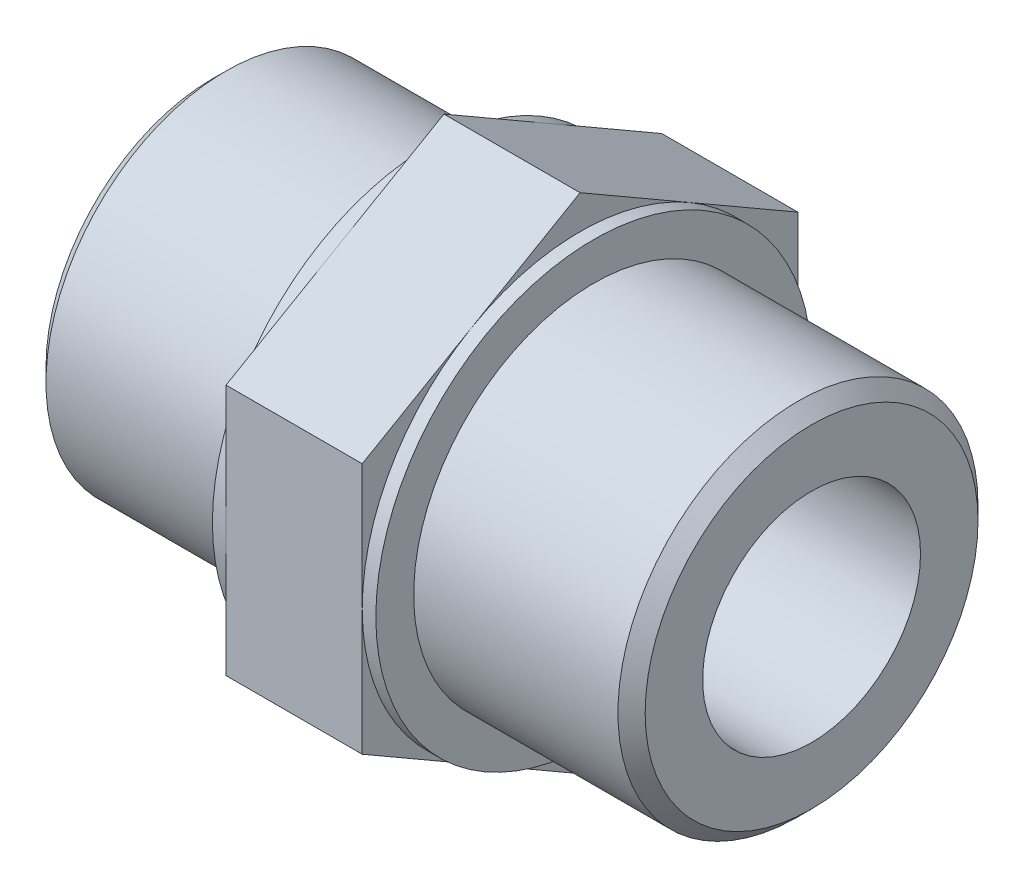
ISO-10303-21;
HEADER;
FILE_DESCRIPTION(('STEP AP214'),'2;1');
FILE_NAME('part.step','',(''),(''),'','','');
FILE_SCHEMA(('AUTOMOTIVE_DESIGN { 1 0 10303 214 1 1 1 1 }'));
ENDSEC;
DATA;
#1=APPLICATION_CONTEXT('core data for automotive mechanical design processes');
#2=APPLICATION_PROTOCOL_DEFINITION('international standard','automotive_design',2000,#1);
#3=PRODUCT_CONTEXT('',#1,'mechanical');
#4=PRODUCT('Part','Part','',(#3));
#5=PRODUCT_RELATED_PRODUCT_CATEGORY('part','',(#4));
#6=PRODUCT_DEFINITION_FORMATION('','',#4);
#7=PRODUCT_DEFINITION_CONTEXT('part definition',#1,'design');
#8=PRODUCT_DEFINITION('design','',#6,#7);
#9=PRODUCT_DEFINITION_SHAPE('','',#8);
#10=(LENGTH_UNIT() NAMED_UNIT(*) SI_UNIT(.MILLI.,.METRE.));
#11=(NAMED_UNIT(*) PLANE_ANGLE_UNIT() SI_UNIT($,.RADIAN.));
#12=(NAMED_UNIT(*) SI_UNIT($,.STERADIAN.) SOLID_ANGLE_UNIT());
#13=UNCERTAINTY_MEASURE_WITH_UNIT(LENGTH_MEASURE(1.E-05),#10,'distance_accuracy_value','');
#14=(GEOMETRIC_REPRESENTATION_CONTEXT(3) GLOBAL_UNCERTAINTY_ASSIGNED_CONTEXT((#13)) GLOBAL_UNIT_ASSIGNED_CONTEXT((#10,
#11,#12)) REPRESENTATION_CONTEXT('',''));
#15=CARTESIAN_POINT('',(0.,0.,0.));
#16=DIRECTION('',(0.,0.,1.));
#17=DIRECTION('',(1.,0.,0.));
#18=AXIS2_PLACEMENT_3D('',#15,#16,#17);
#19=CARTESIAN_POINT('',(-36.444351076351,18.475,0.));
#20=DIRECTION('',(0.999999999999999,0.,0.));
#21=DIRECTION('',(0.,0.,-1.));
#22=AXIS2_PLACEMENT_3D('',#19,#20,#21);
#23=PLANE('',#22);
#24=CARTESIAN_POINT('',(-36.444351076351,0.,0.));
#25=DIRECTION('',(0.999999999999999,0.,0.));
#26=DIRECTION('',(0.,0.,-1.));
#27=AXIS2_PLACEMENT_3D('',#24,#25,#26);
#28=CIRCLE('',#27,18.475);
#29=CARTESIAN_POINT('',(-36.4443510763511,9.23718707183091,-16.));
#30=VERTEX_POINT('',#29);
#31=CARTESIAN_POINT('',(-36.444351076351,9.2378129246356,-15.9996386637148));
#32=VERTEX_POINT('',#31);
#33=EDGE_CURVE('E186',#30,#32,#28,.T.);
#34=ORIENTED_EDGE('',*,*,#33,.T.);
#35=DIRECTION('',(0.,0.499999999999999,0.86602540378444));
#36=VECTOR('',#35,1.);
#37=CARTESIAN_POINT('',(-36.4443510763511,9.23760430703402,-16.));
#38=LINE('',#37,#36);
#39=CARTESIAN_POINT('',(-36.444351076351,13.856406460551,-8.));
#40=VERTEX_POINT('',#39);
#41=EDGE_CURVE('E409',#32,#40,#38,.T.);
#42=ORIENTED_EDGE('',*,*,#41,.T.);
#43=CARTESIAN_POINT('',(-36.444351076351,0.,0.));
#44=DIRECTION('',(0.999999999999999,0.,0.));
#45=DIRECTION('',(0.,0.,-1.));
#46=AXIS2_PLACEMENT_3D('',#43,#44,#45);
#47=CIRCLE('',#46,16.);
#48=CARTESIAN_POINT('',(-36.444351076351,0.,-16.));
#49=VERTEX_POINT('',#48);
#50=EDGE_CURVE('E198',#49,#40,#47,.T.);
#51=ORIENTED_EDGE('',*,*,#50,.F.);
#52=DIRECTION('',(0.,0.999999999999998,0.));
#53=VECTOR('',#52,1.);
#54=CARTESIAN_POINT('',(-36.4443510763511,-9.23760430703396,-16.));
#55=LINE('',#54,#53);
#56=EDGE_CURVE('E391',#49,#30,#55,.T.);
#57=ORIENTED_EDGE('',*,*,#56,.T.);
#58=EDGE_LOOP('',(#34,#42,#51,#57));
#59=FACE_BOUND('',#58,.T.);
#60=ADVANCED_FACE('F35',(#59),#23,.T.);
#61=CARTESIAN_POINT('',(-36.444351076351,13.856406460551,8.00000000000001));
#62=VERTEX_POINT('',#61);
#63=EDGE_CURVE('E202',#40,#62,#47,.T.);
#64=ORIENTED_EDGE('',*,*,#63,.F.);
#65=CARTESIAN_POINT('',(-36.444351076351,18.4749999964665,-0.000361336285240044));
#66=VERTEX_POINT('',#65);
#67=EDGE_CURVE('E185',#40,#66,#38,.T.);
#68=ORIENTED_EDGE('',*,*,#67,.T.);
#69=CARTESIAN_POINT('',(-36.444351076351,18.4749999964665,0.000361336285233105));
#70=VERTEX_POINT('',#69);
#71=EDGE_CURVE('E177',#66,#70,#28,.T.);
#72=ORIENTED_EDGE('',*,*,#71,.T.);
#73=DIRECTION('',(0.,-0.499999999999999,0.866025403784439));
#74=VECTOR('',#73,1.);
#75=CARTESIAN_POINT('',(-36.444351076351,18.475208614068,0.));
#76=LINE('',#75,#74);
#77=EDGE_CURVE('E159',#70,#62,#76,.T.);
#78=ORIENTED_EDGE('',*,*,#77,.T.);
#79=EDGE_LOOP('',(#64,#68,#72,#78));
#80=FACE_BOUND('',#79,.T.);
#81=ADVANCED_FACE('F184',(#80),#23,.T.);
#82=CARTESIAN_POINT('',(-36.444351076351,-9.23781292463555,-15.9996386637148));
#83=VERTEX_POINT('',#82);
#84=CARTESIAN_POINT('',(-36.4443510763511,-9.23718707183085,-16.));
#85=VERTEX_POINT('',#84);
#86=EDGE_CURVE('E191',#83,#85,#28,.T.);
#87=ORIENTED_EDGE('',*,*,#86,.T.);
#88=EDGE_CURVE('E399',#85,#49,#55,.T.);
#89=ORIENTED_EDGE('',*,*,#88,.T.);
#90=CARTESIAN_POINT('',(-36.444351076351,-13.856406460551,-8.00000000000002));
#91=VERTEX_POINT('',#90);
#92=EDGE_CURVE('E190',#91,#49,#47,.T.);
#93=ORIENTED_EDGE('',*,*,#92,.F.);
#94=DIRECTION('',(0.,0.499999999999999,-0.86602540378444));
#95=VECTOR('',#94,1.);
#96=CARTESIAN_POINT('',(-36.4443510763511,-18.475208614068,0.));
#97=LINE('',#96,#95);
#98=EDGE_CURVE('E381',#91,#83,#97,.T.);
#99=ORIENTED_EDGE('',*,*,#98,.T.);
#100=EDGE_LOOP('',(#87,#89,#93,#99));
#101=FACE_BOUND('',#100,.T.);
#102=ADVANCED_FACE('F243',(#101),#23,.T.);
#103=CARTESIAN_POINT('',(-36.444351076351,-18.4749999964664,0.000361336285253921));
#104=VERTEX_POINT('',#103);
#105=CARTESIAN_POINT('',(-36.444351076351,-18.4749999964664,-0.000361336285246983));
#106=VERTEX_POINT('',#105);
#107=EDGE_CURVE('E362',#104,#106,#28,.T.);
#108=ORIENTED_EDGE('',*,*,#107,.T.);
#109=EDGE_CURVE('E388',#106,#91,#97,.T.);
#110=ORIENTED_EDGE('',*,*,#109,.T.);
#111=CARTESIAN_POINT('',(-36.444351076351,-13.856406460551,7.99999999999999));
#112=VERTEX_POINT('',#111);
#113=EDGE_CURVE('E407',#112,#91,#47,.T.);
#114=ORIENTED_EDGE('',*,*,#113,.F.);
#115=DIRECTION('',(0.,-0.499999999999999,-0.86602540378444));
#116=VECTOR('',#115,1.);
#117=CARTESIAN_POINT('',(-36.444351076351,-9.23760430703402,16.));
#118=LINE('',#117,#116);
#119=EDGE_CURVE('E393',#112,#104,#118,.T.);
#120=ORIENTED_EDGE('',*,*,#119,.T.);
#121=EDGE_LOOP('',(#108,#110,#114,#120));
#122=FACE_BOUND('',#121,.T.);
#123=ADVANCED_FACE('F255',(#122),#23,.T.);
#124=CARTESIAN_POINT('',(-36.444351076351,-9.23718707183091,16.));
#125=VERTEX_POINT('',#124);
#126=CARTESIAN_POINT('',(-36.444351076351,-9.23781292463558,15.9996386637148));
#127=VERTEX_POINT('',#126);
#128=EDGE_CURVE('E193',#125,#127,#28,.T.);
#129=ORIENTED_EDGE('',*,*,#128,.T.);
#130=EDGE_CURVE('E389',#127,#112,#118,.T.);
#131=ORIENTED_EDGE('',*,*,#130,.T.);
#132=CARTESIAN_POINT('',(-36.444351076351,0.,16.));
#133=VERTEX_POINT('',#132);
#134=EDGE_CURVE('E413',#133,#112,#47,.T.);
#135=ORIENTED_EDGE('',*,*,#134,.F.);
#136=DIRECTION('',(0.,-0.999999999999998,0.));
#137=VECTOR('',#136,1.);
#138=CARTESIAN_POINT('',(-36.444351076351,9.23760430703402,16.));
#139=LINE('',#138,#137);
#140=EDGE_CURVE('E170',#133,#125,#139,.T.);
#141=ORIENTED_EDGE('',*,*,#140,.T.);
#142=EDGE_LOOP('',(#129,#131,#135,#141));
#143=FACE_BOUND('',#142,.T.);
#144=ADVANCED_FACE('F247',(#143),#23,.T.);
#145=CARTESIAN_POINT('',(-36.444351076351,9.23781292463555,15.9996386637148));
#146=VERTEX_POINT('',#145);
#147=CARTESIAN_POINT('',(-36.444351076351,9.23718707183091,16.));
#148=VERTEX_POINT('',#147);
#149=EDGE_CURVE('E187',#146,#148,#28,.T.);
#150=ORIENTED_EDGE('',*,*,#149,.T.);
#151=EDGE_CURVE('E259',#148,#133,#139,.T.);
#152=ORIENTED_EDGE('',*,*,#151,.T.);
#153=EDGE_CURVE('E412',#62,#133,#47,.T.);
#154=ORIENTED_EDGE('',*,*,#153,.F.);
#155=EDGE_CURVE('E165',#62,#146,#76,.T.);
#156=ORIENTED_EDGE('',*,*,#155,.T.);
#157=EDGE_LOOP('',(#150,#152,#154,#156));
#158=FACE_BOUND('',#157,.T.);
#159=ADVANCED_FACE('F239',(#158),#23,.T.);
#160=CARTESIAN_POINT('',(0.,0.,0.));
#161=DIRECTION('',(0.999999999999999,0.,0.));
#162=DIRECTION('',(0.,0.,-1.));
#163=AXIS2_PLACEMENT_3D('',#160,#161,#162);
#164=CYLINDRICAL_SURFACE('',#163,18.475);
#165=ORIENTED_EDGE('',*,*,#71,.F.);
#166=DIRECTION('',(0.999999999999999,0.,0.));
#167=VECTOR('',#166,1.);
#168=CARTESIAN_POINT('',(0.,18.4749999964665,-0.000361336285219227));
#169=LINE('',#168,#167);
#170=CARTESIAN_POINT('',(-46.444351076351,18.475,-0.000361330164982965));
#171=VERTEX_POINT('',#170);
#172=EDGE_CURVE('E312',#66,#171,#169,.F.);
#173=ORIENTED_EDGE('',*,*,#172,.T.);
#174=CARTESIAN_POINT('',(-46.444351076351,0.,0.));
#175=DIRECTION('',(0.999999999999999,0.,0.));
#176=DIRECTION('',(0.,0.,-1.));
#177=AXIS2_PLACEMENT_3D('',#174,#175,#176);
#178=CIRCLE('',#177,18.475);
#179=CARTESIAN_POINT('',(-46.444351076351,18.4749999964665,0.000361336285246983));
#180=VERTEX_POINT('',#179);
#181=EDGE_CURVE('E179',#171,#180,#178,.T.);
#182=ORIENTED_EDGE('',*,*,#181,.T.);
#183=DIRECTION('',(0.999999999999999,0.,0.));
#184=VECTOR('',#183,1.);
#185=CARTESIAN_POINT('',(0.,18.4749999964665,0.000361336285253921));
#186=LINE('',#185,#184);
#187=EDGE_CURVE('E162',#180,#70,#186,.T.);
#188=ORIENTED_EDGE('',*,*,#187,.T.);
#189=EDGE_LOOP('',(#165,#173,#182,#188));
#190=FACE_BOUND('',#189,.T.);
#191=ADVANCED_FACE('F175',(#190),#164,.T.);
#192=CARTESIAN_POINT('',(-46.444351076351,9.23718707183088,-16.));
#193=VERTEX_POINT('',#192);
#194=CARTESIAN_POINT('',(-46.444351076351,9.23781292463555,-15.9996386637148));
#195=VERTEX_POINT('',#194);
#196=EDGE_CURVE('E196',#193,#195,#178,.T.);
#197=ORIENTED_EDGE('',*,*,#196,.T.);
#198=DIRECTION('',(0.999999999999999,0.,0.));
#199=VECTOR('',#198,1.);
#200=CARTESIAN_POINT('',(0.,9.23781292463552,-15.9996386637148));
#201=LINE('',#200,#199);
#202=EDGE_CURVE('E308',#195,#32,#201,.T.);
#203=ORIENTED_EDGE('',*,*,#202,.T.);
#204=ORIENTED_EDGE('',*,*,#33,.F.);
#205=DIRECTION('',(0.999999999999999,0.,0.));
#206=VECTOR('',#205,1.);
#207=CARTESIAN_POINT('',(0.,9.23718707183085,-16.));
#208=LINE('',#207,#206);
#209=EDGE_CURVE('E302',#30,#193,#208,.F.);
#210=ORIENTED_EDGE('',*,*,#209,.T.);
#211=EDGE_LOOP('',(#197,#203,#204,#210));
#212=FACE_BOUND('',#211,.T.);
#213=ADVANCED_FACE('F253',(#212),#164,.T.);
#214=CARTESIAN_POINT('',(-46.4443510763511,-9.23781292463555,-15.9996386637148));
#215=VERTEX_POINT('',#214);
#216=CARTESIAN_POINT('',(-46.444351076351,-9.23718707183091,-16.));
#217=VERTEX_POINT('',#216);
#218=EDGE_CURVE('E322',#215,#217,#178,.T.);
#219=ORIENTED_EDGE('',*,*,#218,.T.);
#220=DIRECTION('',(0.999999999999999,0.,0.));
#221=VECTOR('',#220,1.);
#222=CARTESIAN_POINT('',(0.,-9.23718707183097,-16.));
#223=LINE('',#222,#221);
#224=EDGE_CURVE('E50',#217,#85,#223,.T.);
#225=ORIENTED_EDGE('',*,*,#224,.T.);
#226=ORIENTED_EDGE('',*,*,#86,.F.);
#227=DIRECTION('',(0.999999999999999,0.,0.));
#228=VECTOR('',#227,1.);
#229=CARTESIAN_POINT('',(0.,-9.23781292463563,-15.9996386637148));
#230=LINE('',#229,#228);
#231=EDGE_CURVE('E295',#83,#215,#230,.F.);
#232=ORIENTED_EDGE('',*,*,#231,.T.);
#233=EDGE_LOOP('',(#219,#225,#226,#232));
#234=FACE_BOUND('',#233,.T.);
#235=ADVANCED_FACE('F378',(#234),#164,.T.);
#236=CARTESIAN_POINT('',(-46.4443510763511,-18.4749999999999,0.000361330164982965));
#237=VERTEX_POINT('',#236);
#238=CARTESIAN_POINT('',(-46.444351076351,-18.4749999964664,-0.000361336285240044));
#239=VERTEX_POINT('',#238);
#240=EDGE_CURVE('E328',#237,#239,#178,.T.);
#241=ORIENTED_EDGE('',*,*,#240,.T.);
#242=DIRECTION('',(0.999999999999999,0.,0.));
#243=VECTOR('',#242,1.);
#244=CARTESIAN_POINT('',(0.,-18.4749999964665,-0.000361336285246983));
#245=LINE('',#244,#243);
#246=EDGE_CURVE('E58',#239,#106,#245,.T.);
#247=ORIENTED_EDGE('',*,*,#246,.T.);
#248=ORIENTED_EDGE('',*,*,#107,.F.);
#249=DIRECTION('',(0.999999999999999,0.,0.));
#250=VECTOR('',#249,1.);
#251=CARTESIAN_POINT('',(0.,-18.4749999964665,0.00036133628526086));
#252=LINE('',#251,#250);
#253=EDGE_CURVE('E288',#104,#237,#252,.F.);
#254=ORIENTED_EDGE('',*,*,#253,.T.);
#255=EDGE_LOOP('',(#241,#247,#248,#254));
#256=FACE_BOUND('',#255,.T.);
#257=ADVANCED_FACE('F370',(#256),#164,.T.);
#258=CARTESIAN_POINT('',(-46.4443510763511,-9.23718707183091,16.));
#259=VERTEX_POINT('',#258);
#260=CARTESIAN_POINT('',(-46.4443510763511,-9.23781292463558,15.9996386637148));
#261=VERTEX_POINT('',#260);
#262=EDGE_CURVE('E363',#259,#261,#178,.T.);
#263=ORIENTED_EDGE('',*,*,#262,.T.);
#264=DIRECTION('',(0.999999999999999,0.,0.));
#265=VECTOR('',#264,1.);
#266=CARTESIAN_POINT('',(1.11022302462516E-13,-9.23781292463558,15.9996386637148));
#267=LINE('',#266,#265);
#268=EDGE_CURVE('E284',#261,#127,#267,.T.);
#269=ORIENTED_EDGE('',*,*,#268,.T.);
#270=ORIENTED_EDGE('',*,*,#128,.F.);
#271=DIRECTION('',(0.999999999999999,0.,0.));
#272=VECTOR('',#271,1.);
#273=CARTESIAN_POINT('',(0.,-9.23718707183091,16.));
#274=LINE('',#273,#272);
#275=EDGE_CURVE('E275',#125,#259,#274,.F.);
#276=ORIENTED_EDGE('',*,*,#275,.T.);
#277=EDGE_LOOP('',(#263,#269,#270,#276));
#278=FACE_BOUND('',#277,.T.);
#279=ADVANCED_FACE('F423',(#278),#164,.T.);
#280=CARTESIAN_POINT('',(-46.4443510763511,9.23781292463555,15.9996386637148));
#281=VERTEX_POINT('',#280);
#282=CARTESIAN_POINT('',(-46.444351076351,9.23718707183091,16.));
#283=VERTEX_POINT('',#282);
#284=EDGE_CURVE('E268',#281,#283,#178,.T.);
#285=ORIENTED_EDGE('',*,*,#284,.T.);
#286=DIRECTION('',(0.999999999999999,0.,0.));
#287=VECTOR('',#286,1.);
#288=CARTESIAN_POINT('',(0.,9.23718707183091,16.));
#289=LINE('',#288,#287);
#290=EDGE_CURVE('E267',#283,#148,#289,.T.);
#291=ORIENTED_EDGE('',*,*,#290,.T.);
#292=ORIENTED_EDGE('',*,*,#149,.F.);
#293=DIRECTION('',(0.999999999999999,0.,0.));
#294=VECTOR('',#293,1.);
#295=CARTESIAN_POINT('',(1.11022302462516E-13,9.23781292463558,15.9996386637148));
#296=LINE('',#295,#294);
#297=EDGE_CURVE('E265',#146,#281,#296,.F.);
#298=ORIENTED_EDGE('',*,*,#297,.T.);
#299=EDGE_LOOP('',(#285,#291,#292,#298));
#300=FACE_BOUND('',#299,.T.);
#301=ADVANCED_FACE('F254',(#300),#164,.T.);
#302=CARTESIAN_POINT('',(-46.444351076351,16.,0.));
#303=DIRECTION('',(-0.999999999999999,0.,0.));
#304=DIRECTION('',(0.,0.,1.));
#305=AXIS2_PLACEMENT_3D('',#302,#303,#304);
#306=PLANE('',#305);
#307=ORIENTED_EDGE('',*,*,#181,.F.);
#308=DIRECTION('',(0.,-0.499999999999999,-0.866025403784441));
#309=VECTOR('',#308,1.);
#310=CARTESIAN_POINT('',(-46.444351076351,17.856406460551,-1.07179676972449));
#311=LINE('',#310,#309);
#312=CARTESIAN_POINT('',(-46.444351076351,13.8564064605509,-7.99999999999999));
#313=VERTEX_POINT('',#312);
#314=EDGE_CURVE('E309',#171,#313,#311,.T.);
#315=ORIENTED_EDGE('',*,*,#314,.T.);
#316=CARTESIAN_POINT('',(-46.444351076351,0.,0.));
#317=DIRECTION('',(0.999999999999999,0.,0.));
#318=DIRECTION('',(0.,0.,-1.));
#319=AXIS2_PLACEMENT_3D('',#316,#317,#318);
#320=CIRCLE('',#319,16.);
#321=CARTESIAN_POINT('',(-46.444351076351,13.856406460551,7.99999999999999));
#322=VERTEX_POINT('',#321);
#323=EDGE_CURVE('E323',#313,#322,#320,.T.);
#324=ORIENTED_EDGE('',*,*,#323,.T.);
#325=DIRECTION('',(0.,0.499999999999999,-0.866025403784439));
#326=VECTOR('',#325,1.);
#327=CARTESIAN_POINT('',(-46.444351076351,17.856406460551,1.0717967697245));
#328=LINE('',#327,#326);
#329=EDGE_CURVE('E181',#322,#180,#328,.T.);
#330=ORIENTED_EDGE('',*,*,#329,.T.);
#331=EDGE_LOOP('',(#307,#315,#324,#330));
#332=FACE_BOUND('',#331,.T.);
#333=ADVANCED_FACE('F354',(#332),#306,.T.);
#334=CARTESIAN_POINT('',(-46.444351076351,0.,-16.));
#335=VERTEX_POINT('',#334);
#336=EDGE_CURVE('E320',#335,#313,#320,.T.);
#337=ORIENTED_EDGE('',*,*,#336,.T.);
#338=EDGE_CURVE('E305',#313,#195,#311,.T.);
#339=ORIENTED_EDGE('',*,*,#338,.T.);
#340=ORIENTED_EDGE('',*,*,#196,.F.);
#341=DIRECTION('',(0.,-0.999999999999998,0.));
#342=VECTOR('',#341,1.);
#343=CARTESIAN_POINT('',(-46.444351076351,16.,-16.));
#344=LINE('',#343,#342);
#345=EDGE_CURVE('E300',#193,#335,#344,.T.);
#346=ORIENTED_EDGE('',*,*,#345,.T.);
#347=EDGE_LOOP('',(#337,#339,#340,#346));
#348=FACE_BOUND('',#347,.T.);
#349=ADVANCED_FACE('F358',(#348),#306,.T.);
#350=CARTESIAN_POINT('',(-46.444351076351,-13.856406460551,-8.00000000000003));
#351=VERTEX_POINT('',#350);
#352=EDGE_CURVE('E319',#351,#335,#320,.T.);
#353=ORIENTED_EDGE('',*,*,#352,.T.);
#354=EDGE_CURVE('E298',#335,#217,#344,.T.);
#355=ORIENTED_EDGE('',*,*,#354,.T.);
#356=ORIENTED_EDGE('',*,*,#218,.F.);
#357=DIRECTION('',(0.,-0.499999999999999,0.866025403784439));
#358=VECTOR('',#357,1.);
#359=CARTESIAN_POINT('',(-46.4443510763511,-9.85640646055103,-14.9282032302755));
#360=LINE('',#359,#358);
#361=EDGE_CURVE('E293',#215,#351,#360,.T.);
#362=ORIENTED_EDGE('',*,*,#361,.T.);
#363=EDGE_LOOP('',(#353,#355,#356,#362));
#364=FACE_BOUND('',#363,.T.);
#365=ADVANCED_FACE('F376',(#364),#306,.T.);
#366=CARTESIAN_POINT('',(-46.444351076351,-13.856406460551,8.));
#367=VERTEX_POINT('',#366);
#368=EDGE_CURVE('E332',#367,#351,#320,.T.);
#369=ORIENTED_EDGE('',*,*,#368,.T.);
#370=EDGE_CURVE('E291',#351,#239,#360,.T.);
#371=ORIENTED_EDGE('',*,*,#370,.T.);
#372=ORIENTED_EDGE('',*,*,#240,.F.);
#373=DIRECTION('',(0.,0.499999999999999,0.86602540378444));
#374=VECTOR('',#373,1.);
#375=CARTESIAN_POINT('',(-46.444351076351,-9.85640646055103,14.9282032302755));
#376=LINE('',#375,#374);
#377=EDGE_CURVE('E285',#237,#367,#376,.T.);
#378=ORIENTED_EDGE('',*,*,#377,.T.);
#379=EDGE_LOOP('',(#369,#371,#372,#378));
#380=FACE_BOUND('',#379,.T.);
#381=ADVANCED_FACE('F373',(#380),#306,.T.);
#382=CARTESIAN_POINT('',(-46.444351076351,0.,16.));
#383=VERTEX_POINT('',#382);
#384=EDGE_CURVE('E337',#383,#367,#320,.T.);
#385=ORIENTED_EDGE('',*,*,#384,.T.);
#386=EDGE_CURVE('E281',#367,#261,#376,.T.);
#387=ORIENTED_EDGE('',*,*,#386,.T.);
#388=ORIENTED_EDGE('',*,*,#262,.F.);
#389=DIRECTION('',(0.,0.999999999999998,0.));
#390=VECTOR('',#389,1.);
#391=CARTESIAN_POINT('',(-46.444351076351,16.,16.));
#392=LINE('',#391,#390);
#393=EDGE_CURVE('E271',#259,#383,#392,.T.);
#394=ORIENTED_EDGE('',*,*,#393,.T.);
#395=EDGE_LOOP('',(#385,#387,#388,#394));
#396=FACE_BOUND('',#395,.T.);
#397=ADVANCED_FACE('F421',(#396),#306,.T.);
#398=EDGE_CURVE('E330',#322,#383,#320,.T.);
#399=ORIENTED_EDGE('',*,*,#398,.T.);
#400=EDGE_CURVE('E272',#383,#283,#392,.T.);
#401=ORIENTED_EDGE('',*,*,#400,.T.);
#402=ORIENTED_EDGE('',*,*,#284,.F.);
#403=EDGE_CURVE('E180',#281,#322,#328,.T.);
#404=ORIENTED_EDGE('',*,*,#403,.T.);
#405=EDGE_LOOP('',(#399,#401,#402,#404));
#406=FACE_BOUND('',#405,.T.);
#407=ADVANCED_FACE('F348',(#406),#306,.T.);
#408=CARTESIAN_POINT('',(0.,0.,0.));
#409=DIRECTION('',(0.999999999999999,0.,0.));
#410=DIRECTION('',(0.,0.,-1.));
#411=AXIS2_PLACEMENT_3D('',#408,#409,#410);
#412=CYLINDRICAL_SURFACE('',#411,13.2205);
#413=CARTESIAN_POINT('',(-62.444351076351,0.,0.));
#414=DIRECTION('',(-0.999999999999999,0.,0.));
#415=DIRECTION('',(0.,0.,1.));
#416=AXIS2_PLACEMENT_3D('',#413,#414,#415);
#417=CIRCLE('',#416,13.2205);
#418=CARTESIAN_POINT('',(-62.444351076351,0.,-13.2205));
#419=VERTEX_POINT('',#418);
#420=EDGE_CURVE('E43',#419,#419,#417,.F.);
#421=CARTESIAN_POINT('',(-47.444351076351,0.,0.));
#422=DIRECTION('',(0.999999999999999,0.,0.));
#423=DIRECTION('',(0.,0.,-1.));
#424=AXIS2_PLACEMENT_3D('',#421,#422,#423);
#425=CIRCLE('',#424,13.2205);
#426=CARTESIAN_POINT('',(-47.444351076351,0.,-13.2205));
#427=VERTEX_POINT('',#426);
#428=EDGE_CURVE('E314',#427,#427,#425,.T.);
#429=CARTESIAN_POINT('',(-62.444351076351,0.,-13.2205));
#430=CARTESIAN_POINT('',(-62.288101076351,0.,-13.2205));
#431=CARTESIAN_POINT('',(-62.131851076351,0.,-13.2205));
#432=CARTESIAN_POINT('',(-61.819351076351,0.,-13.2205));
#433=CARTESIAN_POINT('',(-61.663101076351,0.,-13.2205));
#434=CARTESIAN_POINT('',(-61.350601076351,0.,-13.2205));
#435=CARTESIAN_POINT('',(-61.194351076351,0.,-13.2205));
#436=CARTESIAN_POINT('',(-60.881851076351,0.,-13.2205));
#437=CARTESIAN_POINT('',(-60.725601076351,0.,-13.2205));
#438=CARTESIAN_POINT('',(-60.413101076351,0.,-13.2205));
#439=CARTESIAN_POINT('',(-60.256851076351,0.,-13.2205));
#440=CARTESIAN_POINT('',(-59.944351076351,0.,-13.2205));
#441=CARTESIAN_POINT('',(-59.788101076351,0.,-13.2205));
#442=CARTESIAN_POINT('',(-59.475601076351,0.,-13.2205));
#443=CARTESIAN_POINT('',(-59.319351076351,0.,-13.2205));
#444=CARTESIAN_POINT('',(-59.006851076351,0.,-13.2205));
#445=CARTESIAN_POINT('',(-58.850601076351,0.,-13.2205));
#446=CARTESIAN_POINT('',(-58.538101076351,0.,-13.2205));
#447=CARTESIAN_POINT('',(-58.381851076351,0.,-13.2205));
#448=CARTESIAN_POINT('',(-58.069351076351,0.,-13.2205));
#449=CARTESIAN_POINT('',(-57.913101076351,0.,-13.2205));
#450=CARTESIAN_POINT('',(-57.600601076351,0.,-13.2205));
#451=CARTESIAN_POINT('',(-57.444351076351,0.,-13.2205));
#452=CARTESIAN_POINT('',(-57.131851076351,0.,-13.2205));
#453=CARTESIAN_POINT('',(-56.975601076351,0.,-13.2205));
#454=CARTESIAN_POINT('',(-56.663101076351,0.,-13.2205));
#455=CARTESIAN_POINT('',(-56.506851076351,0.,-13.2205));
#456=CARTESIAN_POINT('',(-56.194351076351,0.,-13.2205));
#457=CARTESIAN_POINT('',(-56.038101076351,0.,-13.2205));
#458=CARTESIAN_POINT('',(-55.725601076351,0.,-13.2205));
#459=CARTESIAN_POINT('',(-55.569351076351,0.,-13.2205));
#460=CARTESIAN_POINT('',(-55.256851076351,0.,-13.2205));
#461=CARTESIAN_POINT('',(-55.100601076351,0.,-13.2205));
#462=CARTESIAN_POINT('',(-54.788101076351,0.,-13.2205));
#463=CARTESIAN_POINT('',(-54.631851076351,0.,-13.2205));
#464=CARTESIAN_POINT('',(-54.319351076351,0.,-13.2205));
#465=CARTESIAN_POINT('',(-54.163101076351,0.,-13.2205));
#466=CARTESIAN_POINT('',(-53.850601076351,0.,-13.2205));
#467=CARTESIAN_POINT('',(-53.694351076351,0.,-13.2205));
#468=CARTESIAN_POINT('',(-53.381851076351,0.,-13.2205));
#469=CARTESIAN_POINT('',(-53.225601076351,0.,-13.2205));
#470=CARTESIAN_POINT('',(-52.913101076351,0.,-13.2205));
#471=CARTESIAN_POINT('',(-52.756851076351,0.,-13.2205));
#472=CARTESIAN_POINT('',(-52.444351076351,0.,-13.2205));
#473=CARTESIAN_POINT('',(-52.288101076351,0.,-13.2205));
#474=CARTESIAN_POINT('',(-51.975601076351,0.,-13.2205));
#475=CARTESIAN_POINT('',(-51.819351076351,0.,-13.2205));
#476=CARTESIAN_POINT('',(-51.506851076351,0.,-13.2205));
#477=CARTESIAN_POINT('',(-51.350601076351,0.,-13.2205));
#478=CARTESIAN_POINT('',(-51.038101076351,0.,-13.2205));
#479=CARTESIAN_POINT('',(-50.881851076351,0.,-13.2205));
#480=CARTESIAN_POINT('',(-50.569351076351,0.,-13.2205));
#481=CARTESIAN_POINT('',(-50.413101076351,0.,-13.2205));
#482=CARTESIAN_POINT('',(-50.100601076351,0.,-13.2205));
#483=CARTESIAN_POINT('',(-49.944351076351,0.,-13.2205));
#484=CARTESIAN_POINT('',(-49.631851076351,0.,-13.2205));
#485=CARTESIAN_POINT('',(-49.475601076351,0.,-13.2205));
#486=CARTESIAN_POINT('',(-49.163101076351,0.,-13.2205));
#487=CARTESIAN_POINT('',(-49.006851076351,0.,-13.2205));
#488=CARTESIAN_POINT('',(-48.694351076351,0.,-13.2205));
#489=CARTESIAN_POINT('',(-48.538101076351,0.,-13.2205));
#490=CARTESIAN_POINT('',(-48.225601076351,0.,-13.2205));
#491=CARTESIAN_POINT('',(-48.069351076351,0.,-13.2205));
#492=CARTESIAN_POINT('',(-47.756851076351,0.,-13.2205));
#493=CARTESIAN_POINT('',(-47.600601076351,0.,-13.2205));
#494=CARTESIAN_POINT('',(-47.444351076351,0.,-13.2205));
#495=B_SPLINE_CURVE_WITH_KNOTS('',3,(#429,#430,#431,#432,#433,#434,#435,#436,#437,#438,#439,
#440,#441,#442,#443,#444,#445,#446,#447,#448,#449,#450,#451,#452,#453,#454,#455,#456,#457,#458,
#459,#460,#461,#462,#463,#464,#465,#466,#467,#468,#469,#470,#471,#472,#473,#474,#475,#476,#477,
#478,#479,#480,#481,#482,#483,#484,#485,#486,#487,#488,#489,#490,#491,#492,#493,#494),
.UNSPECIFIED.,.F.,.F.,(4,2,2,2,2,2,2,2,2,2,2,2,2,2,2,2,2,2,2,2,2,2,2,2,2,2,2,2,2,2,2,2,4),(0.,
0.468750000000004,0.937500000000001,1.40625,1.875,2.34375000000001,2.8125,3.28125000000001,3.75,
4.21875000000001,4.68750000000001,5.15625000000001,5.62500000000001,6.09375000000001,
6.56250000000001,7.03125000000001,7.50000000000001,7.96875,8.43750000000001,8.90625000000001,
9.37500000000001,9.84375000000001,10.3125,10.78125,11.25,11.71875,12.1875,12.65625,13.125,
13.59375,14.0625,14.53125,15.),.UNSPECIFIED.);
#496=EDGE_CURVE('BSEAM37',#419,#427,#495,.T.);
#497=ORIENTED_EDGE('',*,*,#420,.T.);
#498=ORIENTED_EDGE('',*,*,#428,.F.);
#499=ORIENTED_EDGE('',*,*,#496,.T.);
#500=ORIENTED_EDGE('',*,*,#496,.F.);
#501=EDGE_LOOP('',(#497,#499,#498,#500));
#502=FACE_BOUND('',#501,.T.);
#503=ADVANCED_FACE('F37',(#502),#412,.T.);
#504=CARTESIAN_POINT('',(-63.444351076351,7.99999999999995,0.));
#505=DIRECTION('',(-0.999999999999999,0.,0.));
#506=DIRECTION('',(0.,0.,1.));
#507=AXIS2_PLACEMENT_3D('',#504,#505,#506);
#508=PLANE('',#507);
#509=CARTESIAN_POINT('',(-63.444351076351,0.,0.));
#510=DIRECTION('',(-0.999999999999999,0.,0.));
#511=DIRECTION('',(0.,0.,1.));
#512=AXIS2_PLACEMENT_3D('',#509,#510,#511);
#513=CIRCLE('',#512,12.2205);
#514=CARTESIAN_POINT('',(-63.4443510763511,0.,-12.2205));
#515=VERTEX_POINT('',#514);
#516=EDGE_CURVE('E12',#515,#515,#513,.T.);
#517=ORIENTED_EDGE('',*,*,#516,.T.);
#518=EDGE_LOOP('',(#517));
#519=FACE_BOUND('',#518,.T.);
#520=CARTESIAN_POINT('',(-63.444351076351,0.,0.));
#521=DIRECTION('',(0.999999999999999,0.,0.));
#522=DIRECTION('',(0.,0.,-1.));
#523=AXIS2_PLACEMENT_3D('',#520,#521,#522);
#524=CIRCLE('',#523,7.99999999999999);
#525=CARTESIAN_POINT('',(-63.4443510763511,0.,-7.99999999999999));
#526=VERTEX_POINT('',#525);
#527=EDGE_CURVE('E211',#526,#526,#524,.T.);
#528=ORIENTED_EDGE('',*,*,#527,.T.);
#529=EDGE_LOOP('',(#528));
#530=FACE_BOUND('',#529,.T.);
#531=ADVANCED_FACE('F524',(#519,#530),#508,.T.);
#532=CARTESIAN_POINT('',(0.,0.,0.));
#533=DIRECTION('',(0.999999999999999,0.,0.));
#534=DIRECTION('',(0.,0.,-1.));
#535=AXIS2_PLACEMENT_3D('',#532,#533,#534);
#536=CYLINDRICAL_SURFACE('',#535,7.99999999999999);
#537=CARTESIAN_POINT('',(-19.4443510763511,0.,0.));
#538=DIRECTION('',(0.999999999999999,0.,0.));
#539=DIRECTION('',(0.,0.,-1.));
#540=AXIS2_PLACEMENT_3D('',#537,#538,#539);
#541=CIRCLE('',#540,7.99999999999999);
#542=CARTESIAN_POINT('',(-19.4443510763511,0.,-7.99999999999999));
#543=VERTEX_POINT('',#542);
#544=EDGE_CURVE('E208',#543,#543,#541,.T.);
#545=CARTESIAN_POINT('',(-19.4443510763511,0.,-7.99999999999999));
#546=CARTESIAN_POINT('',(-19.9026844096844,0.,-7.99999999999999));
#547=CARTESIAN_POINT('',(-20.3610177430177,0.,-7.99999999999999));
#548=CARTESIAN_POINT('',(-21.2776844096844,0.,-7.99999999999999));
#549=CARTESIAN_POINT('',(-21.7360177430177,0.,-7.99999999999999));
#550=CARTESIAN_POINT('',(-22.6526844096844,0.,-7.99999999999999));
#551=CARTESIAN_POINT('',(-23.1110177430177,0.,-7.99999999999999));
#552=CARTESIAN_POINT('',(-24.0276844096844,0.,-7.99999999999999));
#553=CARTESIAN_POINT('',(-24.4860177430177,0.,-7.99999999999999));
#554=CARTESIAN_POINT('',(-25.4026844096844,0.,-7.99999999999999));
#555=CARTESIAN_POINT('',(-25.8610177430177,0.,-7.99999999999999));
#556=CARTESIAN_POINT('',(-26.7776844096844,0.,-7.99999999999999));
#557=CARTESIAN_POINT('',(-27.2360177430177,0.,-7.99999999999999));
#558=CARTESIAN_POINT('',(-28.1526844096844,0.,-7.99999999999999));
#559=CARTESIAN_POINT('',(-28.6110177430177,0.,-7.99999999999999));
#560=CARTESIAN_POINT('',(-29.5276844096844,0.,-7.99999999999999));
#561=CARTESIAN_POINT('',(-29.9860177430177,0.,-7.99999999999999));
#562=CARTESIAN_POINT('',(-30.9026844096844,0.,-7.99999999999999));
#563=CARTESIAN_POINT('',(-31.3610177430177,0.,-7.99999999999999));
#564=CARTESIAN_POINT('',(-32.2776844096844,0.,-7.99999999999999));
#565=CARTESIAN_POINT('',(-32.7360177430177,0.,-7.99999999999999));
#566=CARTESIAN_POINT('',(-33.6526844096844,0.,-7.99999999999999));
#567=CARTESIAN_POINT('',(-34.1110177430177,0.,-7.99999999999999));
#568=CARTESIAN_POINT('',(-35.0276844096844,0.,-7.99999999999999));
#569=CARTESIAN_POINT('',(-35.4860177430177,0.,-7.99999999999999));
#570=CARTESIAN_POINT('',(-36.4026844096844,0.,-7.99999999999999));
#571=CARTESIAN_POINT('',(-36.8610177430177,0.,-7.99999999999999));
#572=CARTESIAN_POINT('',(-37.7776844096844,0.,-7.99999999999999));
#573=CARTESIAN_POINT('',(-38.2360177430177,0.,-7.99999999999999));
#574=CARTESIAN_POINT('',(-39.1526844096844,0.,-7.99999999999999));
#575=CARTESIAN_POINT('',(-39.6110177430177,0.,-7.99999999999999));
#576=CARTESIAN_POINT('',(-40.5276844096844,0.,-7.99999999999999));
#577=CARTESIAN_POINT('',(-40.9860177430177,0.,-7.99999999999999));
#578=CARTESIAN_POINT('',(-41.9026844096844,0.,-7.99999999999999));
#579=CARTESIAN_POINT('',(-42.3610177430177,0.,-7.99999999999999));
#580=CARTESIAN_POINT('',(-43.2776844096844,0.,-7.99999999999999));
#581=CARTESIAN_POINT('',(-43.7360177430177,0.,-7.99999999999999));
#582=CARTESIAN_POINT('',(-44.6526844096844,0.,-7.99999999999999));
#583=CARTESIAN_POINT('',(-45.1110177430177,0.,-7.99999999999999));
#584=CARTESIAN_POINT('',(-46.0276844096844,0.,-7.99999999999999));
#585=CARTESIAN_POINT('',(-46.4860177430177,0.,-7.99999999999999));
#586=CARTESIAN_POINT('',(-47.4026844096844,0.,-7.99999999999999));
#587=CARTESIAN_POINT('',(-47.8610177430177,0.,-7.99999999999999));
#588=CARTESIAN_POINT('',(-48.7776844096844,0.,-7.99999999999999));
#589=CARTESIAN_POINT('',(-49.2360177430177,0.,-7.99999999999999));
#590=CARTESIAN_POINT('',(-50.1526844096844,0.,-7.99999999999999));
#591=CARTESIAN_POINT('',(-50.6110177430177,0.,-7.99999999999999));
#592=CARTESIAN_POINT('',(-51.5276844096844,0.,-7.99999999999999));
#593=CARTESIAN_POINT('',(-51.9860177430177,0.,-7.99999999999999));
#594=CARTESIAN_POINT('',(-52.9026844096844,0.,-7.99999999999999));
#595=CARTESIAN_POINT('',(-53.3610177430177,0.,-7.99999999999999));
#596=CARTESIAN_POINT('',(-54.2776844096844,0.,-7.99999999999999));
#597=CARTESIAN_POINT('',(-54.7360177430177,0.,-7.99999999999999));
#598=CARTESIAN_POINT('',(-55.6526844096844,0.,-7.99999999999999));
#599=CARTESIAN_POINT('',(-56.1110177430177,0.,-7.99999999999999));
#600=CARTESIAN_POINT('',(-57.0276844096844,0.,-7.99999999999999));
#601=CARTESIAN_POINT('',(-57.4860177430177,0.,-7.99999999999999));
#602=CARTESIAN_POINT('',(-58.4026844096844,0.,-7.99999999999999));
#603=CARTESIAN_POINT('',(-58.8610177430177,0.,-7.99999999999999));
#604=CARTESIAN_POINT('',(-59.7776844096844,0.,-7.99999999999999));
#605=CARTESIAN_POINT('',(-60.2360177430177,0.,-7.99999999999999));
#606=CARTESIAN_POINT('',(-61.1526844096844,0.,-7.99999999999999));
#607=CARTESIAN_POINT('',(-61.6110177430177,0.,-7.99999999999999));
#608=CARTESIAN_POINT('',(-62.5276844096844,0.,-7.99999999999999));
#609=CARTESIAN_POINT('',(-62.9860177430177,0.,-7.99999999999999));
#610=CARTESIAN_POINT('',(-63.4443510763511,0.,-7.99999999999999));
#611=B_SPLINE_CURVE_WITH_KNOTS('',3,(#545,#546,#547,#548,#549,#550,#551,#552,#553,#554,#555,
#556,#557,#558,#559,#560,#561,#562,#563,#564,#565,#566,#567,#568,#569,#570,#571,#572,#573,#574,
#575,#576,#577,#578,#579,#580,#581,#582,#583,#584,#585,#586,#587,#588,#589,#590,#591,#592,#593,
#594,#595,#596,#597,#598,#599,#600,#601,#602,#603,#604,#605,#606,#607,#608,#609,#610),
.UNSPECIFIED.,.F.,.F.,(4,2,2,2,2,2,2,2,2,2,2,2,2,2,2,2,2,2,2,2,2,2,2,2,2,2,2,2,2,2,2,2,4),(0.,
1.375,2.75,4.125,5.5,6.875,8.25,9.625,11.,12.375,13.75,15.125,16.5,17.875,19.25,20.625,22.,
23.375,24.75,26.125,27.5,28.875,30.25,31.625,33.,34.375,35.75,37.125,38.5,39.875,41.25,42.625,
44.),.UNSPECIFIED.);
#612=EDGE_CURVE('BSEAM516',#543,#526,#611,.T.);
#613=ORIENTED_EDGE('',*,*,#544,.T.);
#614=ORIENTED_EDGE('',*,*,#527,.F.);
#615=ORIENTED_EDGE('',*,*,#612,.T.);
#616=ORIENTED_EDGE('',*,*,#612,.F.);
#617=EDGE_LOOP('',(#613,#615,#614,#616));
#618=FACE_BOUND('',#617,.T.);
#619=ADVANCED_FACE('F516',(#618),#536,.F.);
#620=CARTESIAN_POINT('',(-19.444351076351,13.2205,0.));
#621=DIRECTION('',(0.999999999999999,0.,0.));
#622=DIRECTION('',(0.,0.,-1.));
#623=AXIS2_PLACEMENT_3D('',#620,#621,#622);
#624=PLANE('',#623);
#625=CARTESIAN_POINT('',(-19.4443510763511,0.,0.));
#626=DIRECTION('',(0.999999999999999,0.,0.));
#627=DIRECTION('',(0.,0.,-1.));
#628=AXIS2_PLACEMENT_3D('',#625,#626,#627);
#629=CIRCLE('',#628,12.2205);
#630=CARTESIAN_POINT('',(-19.4443510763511,0.,-12.2205));
#631=VERTEX_POINT('',#630);
#632=EDGE_CURVE('E214',#631,#631,#629,.T.);
#633=ORIENTED_EDGE('',*,*,#632,.T.);
#634=EDGE_LOOP('',(#633));
#635=FACE_BOUND('',#634,.T.);
#636=ORIENTED_EDGE('',*,*,#544,.F.);
#637=EDGE_LOOP('',(#636));
#638=FACE_BOUND('',#637,.T.);
#639=ADVANCED_FACE('F508',(#635,#638),#624,.T.);
#640=CARTESIAN_POINT('',(0.,0.,0.));
#641=DIRECTION('',(0.999999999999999,0.,0.));
#642=DIRECTION('',(0.,0.,-1.));
#643=AXIS2_PLACEMENT_3D('',#640,#641,#642);
#644=CYLINDRICAL_SURFACE('',#643,13.2205);
#645=CARTESIAN_POINT('',(-20.4443510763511,0.,0.));
#646=DIRECTION('',(0.999999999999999,0.,0.));
#647=DIRECTION('',(0.,0.,-1.));
#648=AXIS2_PLACEMENT_3D('',#645,#646,#647);
#649=CIRCLE('',#648,13.2205);
#650=CARTESIAN_POINT('',(-20.4443510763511,0.,-13.2205));
#651=VERTEX_POINT('',#650);
#652=EDGE_CURVE('E217',#651,#651,#649,.F.);
#653=CARTESIAN_POINT('',(-35.444351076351,0.,0.));
#654=DIRECTION('',(0.999999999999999,0.,0.));
#655=DIRECTION('',(0.,0.,-1.));
#656=AXIS2_PLACEMENT_3D('',#653,#654,#655);
#657=CIRCLE('',#656,13.2205);
#658=CARTESIAN_POINT('',(-35.4443510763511,0.,-13.2205));
#659=VERTEX_POINT('',#658);
#660=EDGE_CURVE('E205',#659,#659,#657,.T.);
#661=CARTESIAN_POINT('',(-20.4443510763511,0.,-13.2205));
#662=CARTESIAN_POINT('',(-20.6006010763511,0.,-13.2205));
#663=CARTESIAN_POINT('',(-20.7568510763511,0.,-13.2205));
#664=CARTESIAN_POINT('',(-21.0693510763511,0.,-13.2205));
#665=CARTESIAN_POINT('',(-21.2256010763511,0.,-13.2205));
#666=CARTESIAN_POINT('',(-21.5381010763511,0.,-13.2205));
#667=CARTESIAN_POINT('',(-21.6943510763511,0.,-13.2205));
#668=CARTESIAN_POINT('',(-22.0068510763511,0.,-13.2205));
#669=CARTESIAN_POINT('',(-22.1631010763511,0.,-13.2205));
#670=CARTESIAN_POINT('',(-22.4756010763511,0.,-13.2205));
#671=CARTESIAN_POINT('',(-22.6318510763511,0.,-13.2205));
#672=CARTESIAN_POINT('',(-22.9443510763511,0.,-13.2205));
#673=CARTESIAN_POINT('',(-23.1006010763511,0.,-13.2205));
#674=CARTESIAN_POINT('',(-23.4131010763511,0.,-13.2205));
#675=CARTESIAN_POINT('',(-23.5693510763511,0.,-13.2205));
#676=CARTESIAN_POINT('',(-23.8818510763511,0.,-13.2205));
#677=CARTESIAN_POINT('',(-24.0381010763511,0.,-13.2205));
#678=CARTESIAN_POINT('',(-24.3506010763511,0.,-13.2205));
#679=CARTESIAN_POINT('',(-24.5068510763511,0.,-13.2205));
#680=CARTESIAN_POINT('',(-24.8193510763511,0.,-13.2205));
#681=CARTESIAN_POINT('',(-24.9756010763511,0.,-13.2205));
#682=CARTESIAN_POINT('',(-25.2881010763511,0.,-13.2205));
#683=CARTESIAN_POINT('',(-25.4443510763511,0.,-13.2205));
#684=CARTESIAN_POINT('',(-25.7568510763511,0.,-13.2205));
#685=CARTESIAN_POINT('',(-25.9131010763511,0.,-13.2205));
#686=CARTESIAN_POINT('',(-26.2256010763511,0.,-13.2205));
#687=CARTESIAN_POINT('',(-26.3818510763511,0.,-13.2205));
#688=CARTESIAN_POINT('',(-26.6943510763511,0.,-13.2205));
#689=CARTESIAN_POINT('',(-26.8506010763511,0.,-13.2205));
#690=CARTESIAN_POINT('',(-27.1631010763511,0.,-13.2205));
#691=CARTESIAN_POINT('',(-27.3193510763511,0.,-13.2205));
#692=CARTESIAN_POINT('',(-27.6318510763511,0.,-13.2205));
#693=CARTESIAN_POINT('',(-27.7881010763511,0.,-13.2205));
#694=CARTESIAN_POINT('',(-28.1006010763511,0.,-13.2205));
#695=CARTESIAN_POINT('',(-28.2568510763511,0.,-13.2205));
#696=CARTESIAN_POINT('',(-28.5693510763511,0.,-13.2205));
#697=CARTESIAN_POINT('',(-28.7256010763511,0.,-13.2205));
#698=CARTESIAN_POINT('',(-29.0381010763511,0.,-13.2205));
#699=CARTESIAN_POINT('',(-29.1943510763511,0.,-13.2205));
#700=CARTESIAN_POINT('',(-29.5068510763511,0.,-13.2205));
#701=CARTESIAN_POINT('',(-29.6631010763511,0.,-13.2205));
#702=CARTESIAN_POINT('',(-29.9756010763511,0.,-13.2205));
#703=CARTESIAN_POINT('',(-30.1318510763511,0.,-13.2205));
#704=CARTESIAN_POINT('',(-30.4443510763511,0.,-13.2205));
#705=CARTESIAN_POINT('',(-30.6006010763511,0.,-13.2205));
#706=CARTESIAN_POINT('',(-30.9131010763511,0.,-13.2205));
#707=CARTESIAN_POINT('',(-31.0693510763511,0.,-13.2205));
#708=CARTESIAN_POINT('',(-31.3818510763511,0.,-13.2205));
#709=CARTESIAN_POINT('',(-31.5381010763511,0.,-13.2205));
#710=CARTESIAN_POINT('',(-31.8506010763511,0.,-13.2205));
#711=CARTESIAN_POINT('',(-32.0068510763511,0.,-13.2205));
#712=CARTESIAN_POINT('',(-32.3193510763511,0.,-13.2205));
#713=CARTESIAN_POINT('',(-32.4756010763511,0.,-13.2205));
#714=CARTESIAN_POINT('',(-32.788101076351,0.,-13.2205));
#715=CARTESIAN_POINT('',(-32.9443510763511,0.,-13.2205));
#716=CARTESIAN_POINT('',(-33.2568510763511,0.,-13.2205));
#717=CARTESIAN_POINT('',(-33.4131010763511,0.,-13.2205));
#718=CARTESIAN_POINT('',(-33.7256010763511,0.,-13.2205));
#719=CARTESIAN_POINT('',(-33.8818510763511,0.,-13.2205));
#720=CARTESIAN_POINT('',(-34.1943510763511,0.,-13.2205));
#721=CARTESIAN_POINT('',(-34.3506010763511,0.,-13.2205));
#722=CARTESIAN_POINT('',(-34.6631010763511,0.,-13.2205));
#723=CARTESIAN_POINT('',(-34.8193510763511,0.,-13.2205));
#724=CARTESIAN_POINT('',(-35.1318510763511,0.,-13.2205));
#725=CARTESIAN_POINT('',(-35.2881010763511,0.,-13.2205));
#726=CARTESIAN_POINT('',(-35.4443510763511,0.,-13.2205));
#727=B_SPLINE_CURVE_WITH_KNOTS('',3,(#661,#662,#663,#664,#665,#666,#667,#668,#669,#670,#671,
#672,#673,#674,#675,#676,#677,#678,#679,#680,#681,#682,#683,#684,#685,#686,#687,#688,#689,#690,
#691,#692,#693,#694,#695,#696,#697,#698,#699,#700,#701,#702,#703,#704,#705,#706,#707,#708,#709,
#710,#711,#712,#713,#714,#715,#716,#717,#718,#719,#720,#721,#722,#723,#724,#725,#726),
.UNSPECIFIED.,.F.,.F.,(4,2,2,2,2,2,2,2,2,2,2,2,2,2,2,2,2,2,2,2,2,2,2,2,2,2,2,2,2,2,2,2,4),(0.,
0.46875,0.937500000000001,1.40625,1.875,2.34375,2.8125,3.28125,3.75,4.21875,4.6875,5.15625,
5.625,6.09375,6.5625,7.03125,7.5,7.96875,8.4375,8.90625,9.375,9.84375,10.3125,10.78125,11.25,
11.71875,12.1875,12.65625,13.125,13.59375,14.0625,14.53125,15.),.UNSPECIFIED.);
#728=EDGE_CURVE('BSEAM500',#651,#659,#727,.T.);
#729=ORIENTED_EDGE('',*,*,#652,.T.);
#730=ORIENTED_EDGE('',*,*,#660,.T.);
#731=ORIENTED_EDGE('',*,*,#728,.T.);
#732=ORIENTED_EDGE('',*,*,#728,.F.);
#733=EDGE_LOOP('',(#729,#731,#730,#732));
#734=FACE_BOUND('',#733,.T.);
#735=ADVANCED_FACE('F500',(#734),#644,.T.);
#736=CARTESIAN_POINT('',(-35.4443510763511,16.,0.));
#737=DIRECTION('',(0.999999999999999,0.,0.));
#738=DIRECTION('',(0.,0.,-1.));
#739=AXIS2_PLACEMENT_3D('',#736,#737,#738);
#740=PLANE('',#739);
#741=CARTESIAN_POINT('',(-35.444351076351,0.,0.));
#742=DIRECTION('',(0.999999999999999,0.,0.));
#743=DIRECTION('',(0.,0.,-1.));
#744=AXIS2_PLACEMENT_3D('',#741,#742,#743);
#745=CIRCLE('',#744,16.);
#746=CARTESIAN_POINT('',(-35.444351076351,0.,-16.));
#747=VERTEX_POINT('',#746);
#748=EDGE_CURVE('E201',#747,#747,#745,.T.);
#749=ORIENTED_EDGE('',*,*,#748,.T.);
#750=EDGE_LOOP('',(#749));
#751=FACE_BOUND('',#750,.T.);
#752=ORIENTED_EDGE('',*,*,#660,.F.);
#753=EDGE_LOOP('',(#752));
#754=FACE_BOUND('',#753,.T.);
#755=ADVANCED_FACE('F494',(#751,#754),#740,.T.);
#756=CARTESIAN_POINT('',(0.,0.,0.));
#757=DIRECTION('',(0.999999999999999,0.,0.));
#758=DIRECTION('',(0.,0.,-1.));
#759=AXIS2_PLACEMENT_3D('',#756,#757,#758);
#760=CYLINDRICAL_SURFACE('',#759,16.);
#761=ORIENTED_EDGE('',*,*,#50,.T.);
#762=ORIENTED_EDGE('',*,*,#63,.T.);
#763=ORIENTED_EDGE('',*,*,#153,.T.);
#764=ORIENTED_EDGE('',*,*,#134,.T.);
#765=ORIENTED_EDGE('',*,*,#113,.T.);
#766=ORIENTED_EDGE('',*,*,#92,.T.);
#767=EDGE_LOOP('',(#761,#762,#763,#764,#765,#766));
#768=FACE_BOUND('',#767,.T.);
#769=ORIENTED_EDGE('',*,*,#748,.F.);
#770=EDGE_LOOP('',(#769));
#771=FACE_BOUND('',#770,.T.);
#772=ADVANCED_FACE('F402',(#768,#771),#760,.T.);
#773=CARTESIAN_POINT('',(0.,0.,0.));
#774=DIRECTION('',(0.999999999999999,0.,0.));
#775=DIRECTION('',(0.,0.,-1.));
#776=AXIS2_PLACEMENT_3D('',#773,#774,#775);
#777=CYLINDRICAL_SURFACE('',#776,16.);
#778=CARTESIAN_POINT('',(-47.444351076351,0.,0.));
#779=DIRECTION('',(0.999999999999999,0.,0.));
#780=DIRECTION('',(0.,0.,-1.));
#781=AXIS2_PLACEMENT_3D('',#778,#779,#780);
#782=CIRCLE('',#781,16.);
#783=CARTESIAN_POINT('',(-47.444351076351,0.,-16.));
#784=VERTEX_POINT('',#783);
#785=EDGE_CURVE('E317',#784,#784,#782,.T.);
#786=ORIENTED_EDGE('',*,*,#785,.T.);
#787=EDGE_LOOP('',(#786));
#788=FACE_BOUND('',#787,.T.);
#789=ORIENTED_EDGE('',*,*,#323,.F.);
#790=ORIENTED_EDGE('',*,*,#336,.F.);
#791=ORIENTED_EDGE('',*,*,#352,.F.);
#792=ORIENTED_EDGE('',*,*,#368,.F.);
#793=ORIENTED_EDGE('',*,*,#384,.F.);
#794=ORIENTED_EDGE('',*,*,#398,.F.);
#795=EDGE_LOOP('',(#789,#790,#791,#792,#793,#794));
#796=FACE_BOUND('',#795,.T.);
#797=ADVANCED_FACE('F351',(#788,#796),#777,.T.);
#798=CARTESIAN_POINT('',(-47.444351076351,13.2205,0.));
#799=DIRECTION('',(-0.999999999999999,0.,0.));
#800=DIRECTION('',(0.,0.,1.));
#801=AXIS2_PLACEMENT_3D('',#798,#799,#800);
#802=PLANE('',#801);
#803=ORIENTED_EDGE('',*,*,#428,.T.);
#804=EDGE_LOOP('',(#803));
#805=FACE_BOUND('',#804,.T.);
#806=ORIENTED_EDGE('',*,*,#785,.F.);
#807=EDGE_LOOP('',(#806));
#808=FACE_BOUND('',#807,.T.);
#809=ADVANCED_FACE('F434',(#805,#808),#802,.T.);
#810=CARTESIAN_POINT('',(-63.444351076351,18.475208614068,0.));
#811=DIRECTION('',(0.,0.866025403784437,0.500000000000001));
#812=DIRECTION('',(0.,-0.499999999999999,0.866025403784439));
#813=AXIS2_PLACEMENT_3D('',#810,#811,#812);
#814=PLANE('',#813);
#815=ORIENTED_EDGE('',*,*,#155,.F.);
#816=ORIENTED_EDGE('',*,*,#77,.F.);
#817=ORIENTED_EDGE('',*,*,#187,.F.);
#818=ORIENTED_EDGE('',*,*,#329,.F.);
#819=ORIENTED_EDGE('',*,*,#403,.F.);
#820=ORIENTED_EDGE('',*,*,#297,.F.);
#821=EDGE_LOOP('',(#815,#816,#817,#818,#819,#820));
#822=FACE_BOUND('',#821,.T.);
#823=ADVANCED_FACE('F161',(#822),#814,.T.);
#824=CARTESIAN_POINT('',(-63.444351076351,9.23760430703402,16.));
#825=DIRECTION('',(0.,0.,1.));
#826=DIRECTION('',(0.,-0.999999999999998,0.));
#827=AXIS2_PLACEMENT_3D('',#824,#825,#826);
#828=PLANE('',#827);
#829=ORIENTED_EDGE('',*,*,#140,.F.);
#830=ORIENTED_EDGE('',*,*,#151,.F.);
#831=ORIENTED_EDGE('',*,*,#290,.F.);
#832=ORIENTED_EDGE('',*,*,#400,.F.);
#833=ORIENTED_EDGE('',*,*,#393,.F.);
#834=ORIENTED_EDGE('',*,*,#275,.F.);
#835=EDGE_LOOP('',(#829,#830,#831,#832,#833,#834));
#836=FACE_BOUND('',#835,.T.);
#837=ADVANCED_FACE('F422',(#836),#828,.T.);
#838=CARTESIAN_POINT('',(-63.444351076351,-9.23760430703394,16.));
#839=DIRECTION('',(0.,-0.866025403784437,0.5));
#840=DIRECTION('',(0.,-0.499999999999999,-0.86602540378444));
#841=AXIS2_PLACEMENT_3D('',#838,#839,#840);
#842=PLANE('',#841);
#843=ORIENTED_EDGE('',*,*,#119,.F.);
#844=ORIENTED_EDGE('',*,*,#130,.F.);
#845=ORIENTED_EDGE('',*,*,#268,.F.);
#846=ORIENTED_EDGE('',*,*,#386,.F.);
#847=ORIENTED_EDGE('',*,*,#377,.F.);
#848=ORIENTED_EDGE('',*,*,#253,.F.);
#849=EDGE_LOOP('',(#843,#844,#845,#846,#847,#848));
#850=FACE_BOUND('',#849,.T.);
#851=ADVANCED_FACE('F420',(#850),#842,.T.);
#852=CARTESIAN_POINT('',(-63.444351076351,-18.475208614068,0.));
#853=DIRECTION('',(0.,-0.866025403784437,-0.500000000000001));
#854=DIRECTION('',(0.,0.499999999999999,-0.866025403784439));
#855=AXIS2_PLACEMENT_3D('',#852,#853,#854);
#856=PLANE('',#855);
#857=ORIENTED_EDGE('',*,*,#98,.F.);
#858=ORIENTED_EDGE('',*,*,#109,.F.);
#859=ORIENTED_EDGE('',*,*,#246,.F.);
#860=ORIENTED_EDGE('',*,*,#370,.F.);
#861=ORIENTED_EDGE('',*,*,#361,.F.);
#862=ORIENTED_EDGE('',*,*,#231,.F.);
#863=EDGE_LOOP('',(#857,#858,#859,#860,#861,#862));
#864=FACE_BOUND('',#863,.T.);
#865=ADVANCED_FACE('F374',(#864),#856,.T.);
#866=CARTESIAN_POINT('',(-63.444351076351,-9.23760430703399,-16.));
#867=DIRECTION('',(0.,0.,-1.));
#868=DIRECTION('',(0.,0.999999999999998,0.));
#869=AXIS2_PLACEMENT_3D('',#866,#867,#868);
#870=PLANE('',#869);
#871=ORIENTED_EDGE('',*,*,#56,.F.);
#872=ORIENTED_EDGE('',*,*,#88,.F.);
#873=ORIENTED_EDGE('',*,*,#224,.F.);
#874=ORIENTED_EDGE('',*,*,#354,.F.);
#875=ORIENTED_EDGE('',*,*,#345,.F.);
#876=ORIENTED_EDGE('',*,*,#209,.F.);
#877=EDGE_LOOP('',(#871,#872,#873,#874,#875,#876));
#878=FACE_BOUND('',#877,.T.);
#879=ADVANCED_FACE('F441',(#878),#870,.T.);
#880=CARTESIAN_POINT('',(-63.444351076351,9.23760430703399,-16.));
#881=DIRECTION('',(0.,0.866025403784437,-0.5));
#882=DIRECTION('',(0.,0.499999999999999,0.866025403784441));
#883=AXIS2_PLACEMENT_3D('',#880,#881,#882);
#884=PLANE('',#883);
#885=ORIENTED_EDGE('',*,*,#67,.F.);
#886=ORIENTED_EDGE('',*,*,#41,.F.);
#887=ORIENTED_EDGE('',*,*,#202,.F.);
#888=ORIENTED_EDGE('',*,*,#338,.F.);
#889=ORIENTED_EDGE('',*,*,#314,.F.);
#890=ORIENTED_EDGE('',*,*,#172,.F.);
#891=EDGE_LOOP('',(#885,#886,#887,#888,#889,#890));
#892=FACE_BOUND('',#891,.T.);
#893=ADVANCED_FACE('F232',(#892),#884,.T.);
#894=CARTESIAN_POINT('',(-19.4443510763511,0.,0.));
#895=DIRECTION('',(-0.999999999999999,0.,0.));
#896=DIRECTION('',(0.,0.,1.));
#897=AXIS2_PLACEMENT_3D('',#894,#895,#896);
#898=CONICAL_SURFACE('',#897,12.2205,0.785398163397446);
#899=ORIENTED_EDGE('',*,*,#652,.F.);
#900=EDGE_LOOP('',(#899));
#901=FACE_BOUND('',#900,.T.);
#902=ORIENTED_EDGE('',*,*,#632,.F.);
#903=EDGE_LOOP('',(#902));
#904=FACE_BOUND('',#903,.T.);
#905=ADVANCED_FACE('F226',(#901,#904),#898,.T.);
#906=CARTESIAN_POINT('',(-62.444351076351,0.,0.));
#907=DIRECTION('',(0.999999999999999,0.,0.));
#908=DIRECTION('',(0.,0.,-1.));
#909=AXIS2_PLACEMENT_3D('',#906,#907,#908);
#910=CONICAL_SURFACE('',#909,13.2205,0.785398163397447);
#911=CARTESIAN_POINT('',(-63.4443510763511,0.,-12.2205));
#912=CARTESIAN_POINT('',(-63.4339344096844,0.,-12.2309166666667));
#913=CARTESIAN_POINT('',(-63.4235177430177,0.,-12.2413333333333));
#914=CARTESIAN_POINT('',(-63.4026844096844,0.,-12.2621666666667));
#915=CARTESIAN_POINT('',(-63.3922677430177,0.,-12.2725833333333));
#916=CARTESIAN_POINT('',(-63.3714344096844,0.,-12.2934166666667));
#917=CARTESIAN_POINT('',(-63.3610177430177,0.,-12.3038333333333));
#918=CARTESIAN_POINT('',(-63.3401844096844,0.,-12.3246666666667));
#919=CARTESIAN_POINT('',(-63.3297677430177,0.,-12.3350833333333));
#920=CARTESIAN_POINT('',(-63.3089344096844,0.,-12.3559166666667));
#921=CARTESIAN_POINT('',(-63.2985177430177,0.,-12.3663333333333));
#922=CARTESIAN_POINT('',(-63.2776844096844,0.,-12.3871666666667));
#923=CARTESIAN_POINT('',(-63.2672677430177,0.,-12.3975833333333));
#924=CARTESIAN_POINT('',(-63.2464344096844,0.,-12.4184166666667));
#925=CARTESIAN_POINT('',(-63.2360177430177,0.,-12.4288333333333));
#926=CARTESIAN_POINT('',(-63.2151844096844,0.,-12.4496666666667));
#927=CARTESIAN_POINT('',(-63.2047677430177,0.,-12.4600833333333));
#928=CARTESIAN_POINT('',(-63.1839344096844,0.,-12.4809166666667));
#929=CARTESIAN_POINT('',(-63.1735177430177,0.,-12.4913333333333));
#930=CARTESIAN_POINT('',(-63.1526844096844,0.,-12.5121666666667));
#931=CARTESIAN_POINT('',(-63.1422677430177,0.,-12.5225833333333));
#932=CARTESIAN_POINT('',(-63.1214344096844,0.,-12.5434166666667));
#933=CARTESIAN_POINT('',(-63.1110177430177,0.,-12.5538333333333));
#934=CARTESIAN_POINT('',(-63.0901844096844,0.,-12.5746666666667));
#935=CARTESIAN_POINT('',(-63.0797677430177,0.,-12.5850833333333));
#936=CARTESIAN_POINT('',(-63.0589344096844,0.,-12.6059166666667));
#937=CARTESIAN_POINT('',(-63.0485177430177,0.,-12.6163333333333));
#938=CARTESIAN_POINT('',(-63.0276844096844,0.,-12.6371666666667));
#939=CARTESIAN_POINT('',(-63.0172677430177,0.,-12.6475833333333));
#940=CARTESIAN_POINT('',(-62.9964344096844,0.,-12.6684166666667));
#941=CARTESIAN_POINT('',(-62.9860177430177,0.,-12.6788333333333));
#942=CARTESIAN_POINT('',(-62.9651844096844,0.,-12.6996666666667));
#943=CARTESIAN_POINT('',(-62.9547677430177,0.,-12.7100833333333));
#944=CARTESIAN_POINT('',(-62.9339344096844,0.,-12.7309166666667));
#945=CARTESIAN_POINT('',(-62.9235177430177,0.,-12.7413333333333));
#946=CARTESIAN_POINT('',(-62.9026844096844,0.,-12.7621666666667));
#947=CARTESIAN_POINT('',(-62.8922677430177,0.,-12.7725833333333));
#948=CARTESIAN_POINT('',(-62.8714344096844,0.,-12.7934166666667));
#949=CARTESIAN_POINT('',(-62.8610177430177,0.,-12.8038333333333));
#950=CARTESIAN_POINT('',(-62.8401844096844,0.,-12.8246666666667));
#951=CARTESIAN_POINT('',(-62.8297677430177,0.,-12.8350833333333));
#952=CARTESIAN_POINT('',(-62.8089344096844,0.,-12.8559166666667));
#953=CARTESIAN_POINT('',(-62.7985177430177,0.,-12.8663333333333));
#954=CARTESIAN_POINT('',(-62.7776844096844,0.,-12.8871666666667));
#955=CARTESIAN_POINT('',(-62.7672677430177,0.,-12.8975833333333));
#956=CARTESIAN_POINT('',(-62.7464344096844,0.,-12.9184166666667));
#957=CARTESIAN_POINT('',(-62.7360177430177,0.,-12.9288333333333));
#958=CARTESIAN_POINT('',(-62.7151844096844,0.,-12.9496666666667));
#959=CARTESIAN_POINT('',(-62.7047677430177,0.,-12.9600833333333));
#960=CARTESIAN_POINT('',(-62.6839344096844,0.,-12.9809166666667));
#961=CARTESIAN_POINT('',(-62.6735177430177,0.,-12.9913333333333));
#962=CARTESIAN_POINT('',(-62.6526844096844,0.,-13.0121666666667));
#963=CARTESIAN_POINT('',(-62.6422677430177,0.,-13.0225833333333));
#964=CARTESIAN_POINT('',(-62.6214344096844,0.,-13.0434166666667));
#965=CARTESIAN_POINT('',(-62.6110177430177,0.,-13.0538333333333));
#966=CARTESIAN_POINT('',(-62.5901844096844,0.,-13.0746666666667));
#967=CARTESIAN_POINT('',(-62.5797677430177,0.,-13.0850833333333));
#968=CARTESIAN_POINT('',(-62.5589344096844,0.,-13.1059166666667));
#969=CARTESIAN_POINT('',(-62.5485177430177,0.,-13.1163333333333));
#970=CARTESIAN_POINT('',(-62.5276844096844,0.,-13.1371666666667));
#971=CARTESIAN_POINT('',(-62.5172677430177,0.,-13.1475833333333));
#972=CARTESIAN_POINT('',(-62.4964344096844,0.,-13.1684166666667));
#973=CARTESIAN_POINT('',(-62.4860177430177,0.,-13.1788333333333));
#974=CARTESIAN_POINT('',(-62.4651844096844,0.,-13.1996666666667));
#975=CARTESIAN_POINT('',(-62.4547677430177,0.,-13.2100833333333));
#976=CARTESIAN_POINT('',(-62.444351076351,0.,-13.2205));
#977=B_SPLINE_CURVE_WITH_KNOTS('',3,(#911,#912,#913,#914,#915,#916,#917,#918,#919,#920,#921,
#922,#923,#924,#925,#926,#927,#928,#929,#930,#931,#932,#933,#934,#935,#936,#937,#938,#939,#940,
#941,#942,#943,#944,#945,#946,#947,#948,#949,#950,#951,#952,#953,#954,#955,#956,#957,#958,#959,
#960,#961,#962,#963,#964,#965,#966,#967,#968,#969,#970,#971,#972,#973,#974,#975,#976),
.UNSPECIFIED.,.F.,.F.,(4,2,2,2,2,2,2,2,2,2,2,2,2,2,2,2,2,2,2,2,2,2,2,2,2,2,2,2,2,2,2,2,4),(0.,
0.0441941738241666,0.0883883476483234,0.13258252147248,0.176776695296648,0.220970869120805,
0.265165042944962,0.309359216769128,0.353553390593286,0.397747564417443,0.4419417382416,
0.486135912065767,0.530330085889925,0.574524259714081,0.618718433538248,0.662912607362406,
0.707106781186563,0.75130095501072,0.795495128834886,0.839689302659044,0.883883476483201,
0.928077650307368,0.972271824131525,1.01646599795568,1.06066017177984,1.10485434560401,
1.14904851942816,1.19324269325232,1.23743686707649,1.28163104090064,1.3258252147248,
1.37001938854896,1.41421356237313),.UNSPECIFIED.);
#978=EDGE_CURVE('BSEAM224',#515,#419,#977,.T.);
#979=ORIENTED_EDGE('',*,*,#516,.F.);
#980=ORIENTED_EDGE('',*,*,#420,.F.);
#981=ORIENTED_EDGE('',*,*,#978,.T.);
#982=ORIENTED_EDGE('',*,*,#978,.F.);
#983=EDGE_LOOP('',(#979,#981,#980,#982));
#984=FACE_BOUND('',#983,.T.);
#985=ADVANCED_FACE('F224',(#984),#910,.T.);
#986=CLOSED_SHELL('',(#60,#81,#102,#123,#144,#159,#191,#213,#235,#257,#279,#301,#333,#349,#365,
#381,#397,#407,#503,#531,#619,#639,#735,#755,#772,#797,#809,#823,#837,#851,#865,#879,#893,#905,#985));
#987=MANIFOLD_SOLID_BREP('B2',#986);
#988=ADVANCED_BREP_SHAPE_REPRESENTATION('',(#18,#987),#14);
#989=SHAPE_DEFINITION_REPRESENTATION(#9,#988);
ENDSEC;
END-ISO-10303-21;
